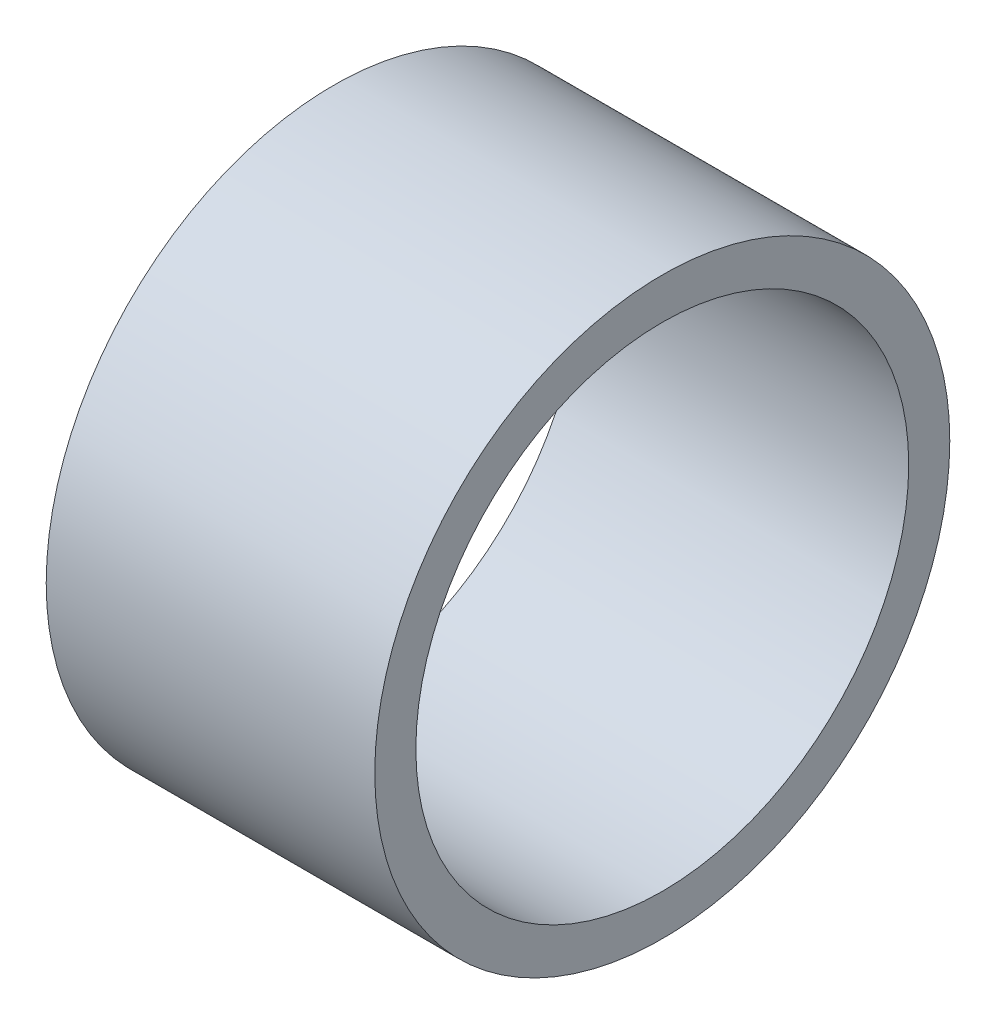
ISO-10303-21;
HEADER;
FILE_DESCRIPTION(('STEP AP214'),'2;1');
FILE_NAME('part.step','',(''),(''),'','','');
FILE_SCHEMA(('AUTOMOTIVE_DESIGN { 1 0 10303 214 1 1 1 1 }'));
ENDSEC;
DATA;
#1=APPLICATION_CONTEXT('core data for automotive mechanical design processes');
#2=APPLICATION_PROTOCOL_DEFINITION('international standard','automotive_design',2000,#1);
#3=PRODUCT_CONTEXT('',#1,'mechanical');
#4=PRODUCT('Part','Part','',(#3));
#5=PRODUCT_RELATED_PRODUCT_CATEGORY('part','',(#4));
#6=PRODUCT_DEFINITION_FORMATION('','',#4);
#7=PRODUCT_DEFINITION_CONTEXT('part definition',#1,'design');
#8=PRODUCT_DEFINITION('design','',#6,#7);
#9=PRODUCT_DEFINITION_SHAPE('','',#8);
#10=(LENGTH_UNIT() NAMED_UNIT(*) SI_UNIT(.MILLI.,.METRE.));
#11=(NAMED_UNIT(*) PLANE_ANGLE_UNIT() SI_UNIT($,.RADIAN.));
#12=(NAMED_UNIT(*) SI_UNIT($,.STERADIAN.) SOLID_ANGLE_UNIT());
#13=UNCERTAINTY_MEASURE_WITH_UNIT(LENGTH_MEASURE(1.E-05),#10,'distance_accuracy_value','');
#14=(GEOMETRIC_REPRESENTATION_CONTEXT(3) GLOBAL_UNCERTAINTY_ASSIGNED_CONTEXT((#13)) GLOBAL_UNIT_ASSIGNED_CONTEXT((#10,
#11,#12)) REPRESENTATION_CONTEXT('',''));
#15=CARTESIAN_POINT('',(0.,0.,0.));
#16=DIRECTION('',(0.,0.,1.));
#17=DIRECTION('',(1.,0.,0.));
#18=AXIS2_PLACEMENT_3D('',#15,#16,#17);
#19=CARTESIAN_POINT('',(50.8,0.,0.));
#20=DIRECTION('',(-1.,0.,0.));
#21=DIRECTION('',(0.,0.,1.));
#22=AXIS2_PLACEMENT_3D('',#19,#20,#21);
#23=CYLINDRICAL_SURFACE('',#22,38.1);
#24=CARTESIAN_POINT('',(50.8,0.,0.));
#25=DIRECTION('',(1.,0.,0.));
#26=DIRECTION('',(0.,0.,-1.));
#27=AXIS2_PLACEMENT_3D('',#24,#25,#26);
#28=CIRCLE('',#27,38.1);
#29=CARTESIAN_POINT('',(50.8,0.,-38.1));
#30=VERTEX_POINT('',#29);
#31=EDGE_CURVE('E53',#30,#30,#28,.T.);
#32=ORIENTED_EDGE('',*,*,#31,.T.);
#33=EDGE_LOOP('',(#32));
#34=FACE_BOUND('',#33,.T.);
#35=CARTESIAN_POINT('',(0.,0.,0.));
#36=DIRECTION('',(1.,0.,0.));
#37=DIRECTION('',(0.,0.,-1.));
#38=AXIS2_PLACEMENT_3D('',#35,#36,#37);
#39=CIRCLE('',#38,38.1);
#40=CARTESIAN_POINT('',(0.,0.,-38.1));
#41=VERTEX_POINT('',#40);
#42=EDGE_CURVE('E60',#41,#41,#39,.T.);
#43=ORIENTED_EDGE('',*,*,#42,.F.);
#44=EDGE_LOOP('',(#43));
#45=FACE_BOUND('',#44,.T.);
#46=ADVANCED_FACE('F45',(#34,#45),#23,.F.);
#47=CARTESIAN_POINT('',(50.8,0.,0.));
#48=DIRECTION('',(-1.,0.,0.));
#49=DIRECTION('',(0.,0.,1.));
#50=AXIS2_PLACEMENT_3D('',#47,#48,#49);
#51=CYLINDRICAL_SURFACE('',#50,44.45);
#52=CARTESIAN_POINT('',(50.8,0.,0.));
#53=DIRECTION('',(1.,0.,0.));
#54=DIRECTION('',(0.,0.,-1.));
#55=AXIS2_PLACEMENT_3D('',#52,#53,#54);
#56=CIRCLE('',#55,44.45);
#57=CARTESIAN_POINT('',(50.8,0.,-44.45));
#58=VERTEX_POINT('',#57);
#59=EDGE_CURVE('E10',#58,#58,#56,.T.);
#60=ORIENTED_EDGE('',*,*,#59,.F.);
#61=EDGE_LOOP('',(#60));
#62=FACE_BOUND('',#61,.T.);
#63=CARTESIAN_POINT('',(0.,0.,0.));
#64=DIRECTION('',(1.,0.,0.));
#65=DIRECTION('',(0.,0.,-1.));
#66=AXIS2_PLACEMENT_3D('',#63,#64,#65);
#67=CIRCLE('',#66,44.45);
#68=CARTESIAN_POINT('',(0.,0.,-44.45));
#69=VERTEX_POINT('',#68);
#70=EDGE_CURVE('E48',#69,#69,#67,.T.);
#71=ORIENTED_EDGE('',*,*,#70,.T.);
#72=EDGE_LOOP('',(#71));
#73=FACE_BOUND('',#72,.T.);
#74=ADVANCED_FACE('F69',(#62,#73),#51,.T.);
#75=CARTESIAN_POINT('',(50.8,0.,0.));
#76=DIRECTION('',(1.,0.,0.));
#77=DIRECTION('',(0.,0.,-1.));
#78=AXIS2_PLACEMENT_3D('',#75,#76,#77);
#79=PLANE('',#78);
#80=ORIENTED_EDGE('',*,*,#31,.F.);
#81=EDGE_LOOP('',(#80));
#82=FACE_BOUND('',#81,.T.);
#83=ORIENTED_EDGE('',*,*,#59,.T.);
#84=EDGE_LOOP('',(#83));
#85=FACE_BOUND('',#84,.T.);
#86=ADVANCED_FACE('F73',(#82,#85),#79,.T.);
#87=CARTESIAN_POINT('',(0.,0.,0.));
#88=DIRECTION('',(1.,0.,0.));
#89=DIRECTION('',(0.,0.,-1.));
#90=AXIS2_PLACEMENT_3D('',#87,#88,#89);
#91=PLANE('',#90);
#92=ORIENTED_EDGE('',*,*,#42,.T.);
#93=EDGE_LOOP('',(#92));
#94=FACE_BOUND('',#93,.T.);
#95=ORIENTED_EDGE('',*,*,#70,.F.);
#96=EDGE_LOOP('',(#95));
#97=FACE_BOUND('',#96,.T.);
#98=ADVANCED_FACE('F71',(#94,#97),#91,.F.);
#99=CLOSED_SHELL('',(#46,#74,#86,#98));
#100=MANIFOLD_SOLID_BREP('B2',#99);
#101=ADVANCED_BREP_SHAPE_REPRESENTATION('',(#18,#100),#14);
#102=SHAPE_DEFINITION_REPRESENTATION(#9,#101);
ENDSEC;
END-ISO-10303-21;
